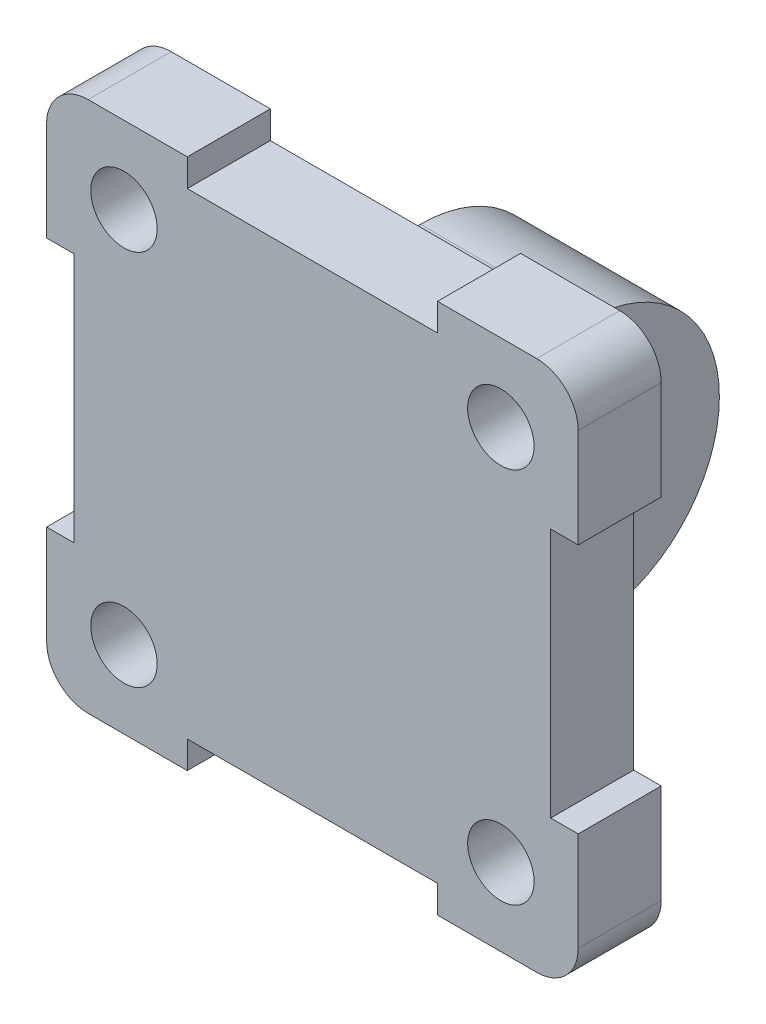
ISO-10303-21;
HEADER;
FILE_DESCRIPTION(('STEP AP214'),'2;1');
FILE_NAME('part.step','',(''),(''),'','','');
FILE_SCHEMA(('AUTOMOTIVE_DESIGN { 1 0 10303 214 1 1 1 1 }'));
ENDSEC;
DATA;
#1=APPLICATION_CONTEXT('core data for automotive mechanical design processes');
#2=APPLICATION_PROTOCOL_DEFINITION('international standard','automotive_design',2000,#1);
#3=PRODUCT_CONTEXT('',#1,'mechanical');
#4=PRODUCT('Part','Part','',(#3));
#5=PRODUCT_RELATED_PRODUCT_CATEGORY('part','',(#4));
#6=PRODUCT_DEFINITION_FORMATION('','',#4);
#7=PRODUCT_DEFINITION_CONTEXT('part definition',#1,'design');
#8=PRODUCT_DEFINITION('design','',#6,#7);
#9=PRODUCT_DEFINITION_SHAPE('','',#8);
#10=(LENGTH_UNIT() NAMED_UNIT(*) SI_UNIT(.MILLI.,.METRE.));
#11=(NAMED_UNIT(*) PLANE_ANGLE_UNIT() SI_UNIT($,.RADIAN.));
#12=(NAMED_UNIT(*) SI_UNIT($,.STERADIAN.) SOLID_ANGLE_UNIT());
#13=UNCERTAINTY_MEASURE_WITH_UNIT(LENGTH_MEASURE(1.E-05),#10,'distance_accuracy_value','');
#14=(GEOMETRIC_REPRESENTATION_CONTEXT(3) GLOBAL_UNCERTAINTY_ASSIGNED_CONTEXT((#13)) GLOBAL_UNIT_ASSIGNED_CONTEXT((#10,
#11,#12)) REPRESENTATION_CONTEXT('',''));
#15=CARTESIAN_POINT('',(0.,0.,0.));
#16=DIRECTION('',(0.,0.,1.));
#17=DIRECTION('',(1.,0.,0.));
#18=AXIS2_PLACEMENT_3D('',#15,#16,#17);
#19=CARTESIAN_POINT('',(27.,27.,0.));
#20=DIRECTION('',(0.,0.,1.));
#21=DIRECTION('',(1.,0.,0.));
#22=AXIS2_PLACEMENT_3D('',#19,#20,#21);
#23=PLANE('',#22);
#24=CARTESIAN_POINT('',(-22.69,-22.69,0.));
#25=DIRECTION('',(0.,0.,1.));
#26=DIRECTION('',(1.,0.,0.));
#27=AXIS2_PLACEMENT_3D('',#24,#25,#26);
#28=CIRCLE('',#27,4.);
#29=CARTESIAN_POINT('',(-18.69,-22.69,0.));
#30=VERTEX_POINT('',#29);
#31=EDGE_CURVE('E256',#30,#30,#28,.T.);
#32=ORIENTED_EDGE('',*,*,#31,.T.);
#33=EDGE_LOOP('',(#32));
#34=FACE_BOUND('',#33,.T.);
#35=CARTESIAN_POINT('',(22.69,22.69,0.));
#36=DIRECTION('',(0.,0.,1.));
#37=DIRECTION('',(1.,0.,0.));
#38=AXIS2_PLACEMENT_3D('',#35,#36,#37);
#39=CIRCLE('',#38,4.);
#40=CARTESIAN_POINT('',(26.69,22.69,0.));
#41=VERTEX_POINT('',#40);
#42=EDGE_CURVE('E266',#41,#41,#39,.T.);
#43=ORIENTED_EDGE('',*,*,#42,.T.);
#44=EDGE_LOOP('',(#43));
#45=FACE_BOUND('',#44,.T.);
#46=DIRECTION('',(0.,1.,0.));
#47=VECTOR('',#46,1.);
#48=CARTESIAN_POINT('',(-15.065,32.,0.));
#49=LINE('',#48,#47);
#50=CARTESIAN_POINT('',(-15.065,28.69,0.));
#51=VERTEX_POINT('',#50);
#52=CARTESIAN_POINT('',(-15.065,32.,0.));
#53=VERTEX_POINT('',#52);
#54=EDGE_CURVE('E278',#51,#53,#49,.T.);
#55=ORIENTED_EDGE('',*,*,#54,.F.);
#56=DIRECTION('',(-1.,0.,0.));
#57=VECTOR('',#56,1.);
#58=CARTESIAN_POINT('',(-15.065,28.69,0.));
#59=LINE('',#58,#57);
#60=CARTESIAN_POINT('',(15.065,28.69,0.));
#61=VERTEX_POINT('',#60);
#62=EDGE_CURVE('E285',#61,#51,#59,.T.);
#63=ORIENTED_EDGE('',*,*,#62,.F.);
#64=DIRECTION('',(0.,-1.,0.));
#65=VECTOR('',#64,1.);
#66=CARTESIAN_POINT('',(15.065,32.,0.));
#67=LINE('',#66,#65);
#68=CARTESIAN_POINT('',(15.065,32.,0.));
#69=VERTEX_POINT('',#68);
#70=EDGE_CURVE('E376',#69,#61,#67,.T.);
#71=ORIENTED_EDGE('',*,*,#70,.F.);
#72=DIRECTION('',(-1.,0.,0.));
#73=VECTOR('',#72,1.);
#74=CARTESIAN_POINT('',(15.065,32.,0.));
#75=LINE('',#74,#73);
#76=CARTESIAN_POINT('',(27.,32.,0.));
#77=VERTEX_POINT('',#76);
#78=EDGE_CURVE('E374',#77,#69,#75,.T.);
#79=ORIENTED_EDGE('',*,*,#78,.F.);
#80=CARTESIAN_POINT('',(27.,27.,0.));
#81=DIRECTION('',(0.,0.,1.));
#82=DIRECTION('',(1.,0.,0.));
#83=AXIS2_PLACEMENT_3D('',#80,#81,#82);
#84=CIRCLE('',#83,5.);
#85=CARTESIAN_POINT('',(32.,27.,0.));
#86=VERTEX_POINT('',#85);
#87=EDGE_CURVE('E372',#86,#77,#84,.T.);
#88=ORIENTED_EDGE('',*,*,#87,.F.);
#89=DIRECTION('',(0.,1.,0.));
#90=VECTOR('',#89,1.);
#91=CARTESIAN_POINT('',(32.,15.065,0.));
#92=LINE('',#91,#90);
#93=CARTESIAN_POINT('',(32.,15.065,0.));
#94=VERTEX_POINT('',#93);
#95=EDGE_CURVE('E370',#94,#86,#92,.T.);
#96=ORIENTED_EDGE('',*,*,#95,.F.);
#97=DIRECTION('',(1.,0.,0.));
#98=VECTOR('',#97,1.);
#99=CARTESIAN_POINT('',(32.,15.065,0.));
#100=LINE('',#99,#98);
#101=CARTESIAN_POINT('',(28.69,15.065,0.));
#102=VERTEX_POINT('',#101);
#103=EDGE_CURVE('E368',#102,#94,#100,.T.);
#104=ORIENTED_EDGE('',*,*,#103,.F.);
#105=DIRECTION('',(0.,1.,0.));
#106=VECTOR('',#105,1.);
#107=CARTESIAN_POINT('',(28.69,-15.065,0.));
#108=LINE('',#107,#106);
#109=CARTESIAN_POINT('',(28.69,-15.065,0.));
#110=VERTEX_POINT('',#109);
#111=EDGE_CURVE('E366',#110,#102,#108,.T.);
#112=ORIENTED_EDGE('',*,*,#111,.F.);
#113=DIRECTION('',(-1.,0.,0.));
#114=VECTOR('',#113,1.);
#115=CARTESIAN_POINT('',(32.,-15.065,0.));
#116=LINE('',#115,#114);
#117=CARTESIAN_POINT('',(32.,-15.065,0.));
#118=VERTEX_POINT('',#117);
#119=EDGE_CURVE('E364',#118,#110,#116,.T.);
#120=ORIENTED_EDGE('',*,*,#119,.F.);
#121=DIRECTION('',(0.,1.,0.));
#122=VECTOR('',#121,1.);
#123=CARTESIAN_POINT('',(32.,-27.,0.));
#124=LINE('',#123,#122);
#125=CARTESIAN_POINT('',(32.,-27.,0.));
#126=VERTEX_POINT('',#125);
#127=EDGE_CURVE('E362',#126,#118,#124,.T.);
#128=ORIENTED_EDGE('',*,*,#127,.F.);
#129=CARTESIAN_POINT('',(27.,-27.,0.));
#130=DIRECTION('',(0.,0.,1.));
#131=DIRECTION('',(1.,0.,0.));
#132=AXIS2_PLACEMENT_3D('',#129,#130,#131);
#133=CIRCLE('',#132,5.);
#134=CARTESIAN_POINT('',(27.,-32.,0.));
#135=VERTEX_POINT('',#134);
#136=EDGE_CURVE('E360',#135,#126,#133,.T.);
#137=ORIENTED_EDGE('',*,*,#136,.F.);
#138=DIRECTION('',(1.,0.,0.));
#139=VECTOR('',#138,1.);
#140=CARTESIAN_POINT('',(15.065,-32.,0.));
#141=LINE('',#140,#139);
#142=CARTESIAN_POINT('',(15.065,-32.,0.));
#143=VERTEX_POINT('',#142);
#144=EDGE_CURVE('E358',#143,#135,#141,.T.);
#145=ORIENTED_EDGE('',*,*,#144,.F.);
#146=DIRECTION('',(0.,-1.,0.));
#147=VECTOR('',#146,1.);
#148=CARTESIAN_POINT('',(15.065,-32.,0.));
#149=LINE('',#148,#147);
#150=CARTESIAN_POINT('',(15.065,-28.69,0.));
#151=VERTEX_POINT('',#150);
#152=EDGE_CURVE('E356',#151,#143,#149,.T.);
#153=ORIENTED_EDGE('',*,*,#152,.F.);
#154=DIRECTION('',(1.,0.,0.));
#155=VECTOR('',#154,1.);
#156=CARTESIAN_POINT('',(-15.065,-28.69,0.));
#157=LINE('',#156,#155);
#158=CARTESIAN_POINT('',(-15.065,-28.69,0.));
#159=VERTEX_POINT('',#158);
#160=EDGE_CURVE('E354',#159,#151,#157,.T.);
#161=ORIENTED_EDGE('',*,*,#160,.F.);
#162=DIRECTION('',(0.,1.,0.));
#163=VECTOR('',#162,1.);
#164=CARTESIAN_POINT('',(-15.065,-32.,0.));
#165=LINE('',#164,#163);
#166=CARTESIAN_POINT('',(-15.065,-32.,0.));
#167=VERTEX_POINT('',#166);
#168=EDGE_CURVE('E352',#167,#159,#165,.T.);
#169=ORIENTED_EDGE('',*,*,#168,.F.);
#170=DIRECTION('',(1.,0.,0.));
#171=VECTOR('',#170,1.);
#172=CARTESIAN_POINT('',(-27.,-32.,0.));
#173=LINE('',#172,#171);
#174=CARTESIAN_POINT('',(-27.,-32.,0.));
#175=VERTEX_POINT('',#174);
#176=EDGE_CURVE('E350',#175,#167,#173,.T.);
#177=ORIENTED_EDGE('',*,*,#176,.F.);
#178=CARTESIAN_POINT('',(-27.,-27.,0.));
#179=DIRECTION('',(0.,0.,1.));
#180=DIRECTION('',(1.,0.,0.));
#181=AXIS2_PLACEMENT_3D('',#178,#179,#180);
#182=CIRCLE('',#181,5.);
#183=CARTESIAN_POINT('',(-32.,-27.,0.));
#184=VERTEX_POINT('',#183);
#185=EDGE_CURVE('E348',#184,#175,#182,.T.);
#186=ORIENTED_EDGE('',*,*,#185,.F.);
#187=DIRECTION('',(0.,-1.,0.));
#188=VECTOR('',#187,1.);
#189=CARTESIAN_POINT('',(-32.,-27.,0.));
#190=LINE('',#189,#188);
#191=CARTESIAN_POINT('',(-32.,-15.065,0.));
#192=VERTEX_POINT('',#191);
#193=EDGE_CURVE('E346',#192,#184,#190,.T.);
#194=ORIENTED_EDGE('',*,*,#193,.F.);
#195=DIRECTION('',(-1.,0.,0.));
#196=VECTOR('',#195,1.);
#197=CARTESIAN_POINT('',(-32.,-15.065,0.));
#198=LINE('',#197,#196);
#199=CARTESIAN_POINT('',(-28.69,-15.065,0.));
#200=VERTEX_POINT('',#199);
#201=EDGE_CURVE('E344',#200,#192,#198,.T.);
#202=ORIENTED_EDGE('',*,*,#201,.F.);
#203=DIRECTION('',(0.,-1.,0.));
#204=VECTOR('',#203,1.);
#205=CARTESIAN_POINT('',(-28.69,15.065,0.));
#206=LINE('',#205,#204);
#207=CARTESIAN_POINT('',(-28.69,15.065,0.));
#208=VERTEX_POINT('',#207);
#209=EDGE_CURVE('E342',#208,#200,#206,.T.);
#210=ORIENTED_EDGE('',*,*,#209,.F.);
#211=DIRECTION('',(1.,0.,0.));
#212=VECTOR('',#211,1.);
#213=CARTESIAN_POINT('',(-32.,15.065,0.));
#214=LINE('',#213,#212);
#215=CARTESIAN_POINT('',(-32.,15.065,0.));
#216=VERTEX_POINT('',#215);
#217=EDGE_CURVE('E340',#216,#208,#214,.T.);
#218=ORIENTED_EDGE('',*,*,#217,.F.);
#219=DIRECTION('',(0.,-1.,0.));
#220=VECTOR('',#219,1.);
#221=CARTESIAN_POINT('',(-32.,15.065,0.));
#222=LINE('',#221,#220);
#223=CARTESIAN_POINT('',(-32.,27.,0.));
#224=VERTEX_POINT('',#223);
#225=EDGE_CURVE('E338',#224,#216,#222,.T.);
#226=ORIENTED_EDGE('',*,*,#225,.F.);
#227=CARTESIAN_POINT('',(-27.,27.,0.));
#228=DIRECTION('',(0.,0.,1.));
#229=DIRECTION('',(-1.,0.,0.));
#230=AXIS2_PLACEMENT_3D('',#227,#228,#229);
#231=CIRCLE('',#230,5.);
#232=CARTESIAN_POINT('',(-27.,32.,0.));
#233=VERTEX_POINT('',#232);
#234=EDGE_CURVE('E336',#233,#224,#231,.T.);
#235=ORIENTED_EDGE('',*,*,#234,.F.);
#236=DIRECTION('',(-1.,0.,0.));
#237=VECTOR('',#236,1.);
#238=CARTESIAN_POINT('',(-27.,32.,0.));
#239=LINE('',#238,#237);
#240=EDGE_CURVE('E334',#53,#233,#239,.T.);
#241=ORIENTED_EDGE('',*,*,#240,.F.);
#242=EDGE_LOOP('',(#55,#63,#71,#79,#88,#96,#104,#112,#120,#128,#137,#145,#153,#161,#169,#177,
#186,#194,#202,#210,#218,#226,#235,#241));
#243=FACE_BOUND('',#242,.T.);
#244=CARTESIAN_POINT('',(-22.69,22.69,0.));
#245=DIRECTION('',(0.,0.,1.));
#246=DIRECTION('',(1.,0.,0.));
#247=AXIS2_PLACEMENT_3D('',#244,#245,#246);
#248=CIRCLE('',#247,4.);
#249=CARTESIAN_POINT('',(-18.69,22.69,0.));
#250=VERTEX_POINT('',#249);
#251=EDGE_CURVE('E272',#250,#250,#248,.T.);
#252=ORIENTED_EDGE('',*,*,#251,.T.);
#253=EDGE_LOOP('',(#252));
#254=FACE_BOUND('',#253,.T.);
#255=CARTESIAN_POINT('',(22.69,-22.69,0.));
#256=DIRECTION('',(0.,0.,1.));
#257=DIRECTION('',(1.,0.,0.));
#258=AXIS2_PLACEMENT_3D('',#255,#256,#257);
#259=CIRCLE('',#258,4.);
#260=CARTESIAN_POINT('',(26.69,-22.69,0.));
#261=VERTEX_POINT('',#260);
#262=EDGE_CURVE('E260',#261,#261,#259,.T.);
#263=ORIENTED_EDGE('',*,*,#262,.T.);
#264=EDGE_LOOP('',(#263));
#265=FACE_BOUND('',#264,.T.);
#266=DIRECTION('',(-1.,0.,0.));
#267=VECTOR('',#266,1.);
#268=CARTESIAN_POINT('',(10.,-16.,0.));
#269=LINE('',#268,#267);
#270=CARTESIAN_POINT('',(10.,-16.,0.));
#271=VERTEX_POINT('',#270);
#272=CARTESIAN_POINT('',(-10.,-16.,0.));
#273=VERTEX_POINT('',#272);
#274=EDGE_CURVE('E49',#271,#273,#269,.T.);
#275=ORIENTED_EDGE('',*,*,#274,.F.);
#276=DIRECTION('',(0.,-1.,0.));
#277=VECTOR('',#276,1.);
#278=CARTESIAN_POINT('',(10.,16.,0.));
#279=LINE('',#278,#277);
#280=CARTESIAN_POINT('',(10.,16.,0.));
#281=VERTEX_POINT('',#280);
#282=EDGE_CURVE('E225',#281,#271,#279,.T.);
#283=ORIENTED_EDGE('',*,*,#282,.F.);
#284=DIRECTION('',(-1.,0.,0.));
#285=VECTOR('',#284,1.);
#286=CARTESIAN_POINT('',(10.,16.,0.));
#287=LINE('',#286,#285);
#288=CARTESIAN_POINT('',(-10.,16.,0.));
#289=VERTEX_POINT('',#288);
#290=EDGE_CURVE('E241',#281,#289,#287,.T.);
#291=ORIENTED_EDGE('',*,*,#290,.T.);
#292=DIRECTION('',(0.,-1.,0.));
#293=VECTOR('',#292,1.);
#294=CARTESIAN_POINT('',(-10.,16.,0.));
#295=LINE('',#294,#293);
#296=EDGE_CURVE('E54',#289,#273,#295,.T.);
#297=ORIENTED_EDGE('',*,*,#296,.T.);
#298=EDGE_LOOP('',(#275,#283,#291,#297));
#299=FACE_BOUND('',#298,.T.);
#300=ADVANCED_FACE('F34',(#34,#45,#243,#254,#265,#299),#23,.F.);
#301=CARTESIAN_POINT('',(27.,27.,10.));
#302=DIRECTION('',(0.,0.,1.));
#303=DIRECTION('',(1.,0.,0.));
#304=AXIS2_PLACEMENT_3D('',#301,#302,#303);
#305=PLANE('',#304);
#306=CARTESIAN_POINT('',(22.69,-22.69,10.));
#307=DIRECTION('',(0.,0.,1.));
#308=DIRECTION('',(1.,0.,0.));
#309=AXIS2_PLACEMENT_3D('',#306,#307,#308);
#310=CIRCLE('',#309,4.);
#311=CARTESIAN_POINT('',(26.69,-22.69,10.));
#312=VERTEX_POINT('',#311);
#313=EDGE_CURVE('E263',#312,#312,#310,.T.);
#314=ORIENTED_EDGE('',*,*,#313,.F.);
#315=EDGE_LOOP('',(#314));
#316=FACE_BOUND('',#315,.T.);
#317=CARTESIAN_POINT('',(-22.69,22.69,10.));
#318=DIRECTION('',(0.,0.,1.));
#319=DIRECTION('',(1.,0.,0.));
#320=AXIS2_PLACEMENT_3D('',#317,#318,#319);
#321=CIRCLE('',#320,4.);
#322=CARTESIAN_POINT('',(-18.69,22.69,10.));
#323=VERTEX_POINT('',#322);
#324=EDGE_CURVE('E275',#323,#323,#321,.T.);
#325=ORIENTED_EDGE('',*,*,#324,.F.);
#326=EDGE_LOOP('',(#325));
#327=FACE_BOUND('',#326,.T.);
#328=DIRECTION('',(0.,1.,0.));
#329=VECTOR('',#328,1.);
#330=CARTESIAN_POINT('',(-15.065,32.,10.));
#331=LINE('',#330,#329);
#332=CARTESIAN_POINT('',(-15.065,28.69,10.));
#333=VERTEX_POINT('',#332);
#334=CARTESIAN_POINT('',(-15.065,32.,10.));
#335=VERTEX_POINT('',#334);
#336=EDGE_CURVE('E281',#333,#335,#331,.T.);
#337=ORIENTED_EDGE('',*,*,#336,.T.);
#338=DIRECTION('',(-1.,0.,0.));
#339=VECTOR('',#338,1.);
#340=CARTESIAN_POINT('',(-27.,32.,10.));
#341=LINE('',#340,#339);
#342=CARTESIAN_POINT('',(-27.,32.,10.));
#343=VERTEX_POINT('',#342);
#344=EDGE_CURVE('E284',#335,#343,#341,.T.);
#345=ORIENTED_EDGE('',*,*,#344,.T.);
#346=CARTESIAN_POINT('',(-27.,27.,10.));
#347=DIRECTION('',(0.,0.,1.));
#348=DIRECTION('',(-1.,0.,0.));
#349=AXIS2_PLACEMENT_3D('',#346,#347,#348);
#350=CIRCLE('',#349,5.);
#351=CARTESIAN_POINT('',(-32.,27.,10.));
#352=VERTEX_POINT('',#351);
#353=EDGE_CURVE('E287',#343,#352,#350,.T.);
#354=ORIENTED_EDGE('',*,*,#353,.T.);
#355=DIRECTION('',(0.,-1.,0.));
#356=VECTOR('',#355,1.);
#357=CARTESIAN_POINT('',(-32.,15.065,10.));
#358=LINE('',#357,#356);
#359=CARTESIAN_POINT('',(-32.,15.065,10.));
#360=VERTEX_POINT('',#359);
#361=EDGE_CURVE('E289',#352,#360,#358,.T.);
#362=ORIENTED_EDGE('',*,*,#361,.T.);
#363=DIRECTION('',(1.,0.,0.));
#364=VECTOR('',#363,1.);
#365=CARTESIAN_POINT('',(-32.,15.065,10.));
#366=LINE('',#365,#364);
#367=CARTESIAN_POINT('',(-28.69,15.065,10.));
#368=VERTEX_POINT('',#367);
#369=EDGE_CURVE('E291',#360,#368,#366,.T.);
#370=ORIENTED_EDGE('',*,*,#369,.T.);
#371=DIRECTION('',(0.,-1.,0.));
#372=VECTOR('',#371,1.);
#373=CARTESIAN_POINT('',(-28.69,15.065,10.));
#374=LINE('',#373,#372);
#375=CARTESIAN_POINT('',(-28.69,-15.065,10.));
#376=VERTEX_POINT('',#375);
#377=EDGE_CURVE('E293',#368,#376,#374,.T.);
#378=ORIENTED_EDGE('',*,*,#377,.T.);
#379=DIRECTION('',(-1.,0.,0.));
#380=VECTOR('',#379,1.);
#381=CARTESIAN_POINT('',(-32.,-15.065,10.));
#382=LINE('',#381,#380);
#383=CARTESIAN_POINT('',(-32.,-15.065,10.));
#384=VERTEX_POINT('',#383);
#385=EDGE_CURVE('E295',#376,#384,#382,.T.);
#386=ORIENTED_EDGE('',*,*,#385,.T.);
#387=DIRECTION('',(0.,-1.,0.));
#388=VECTOR('',#387,1.);
#389=CARTESIAN_POINT('',(-32.,-27.,10.));
#390=LINE('',#389,#388);
#391=CARTESIAN_POINT('',(-32.,-27.,10.));
#392=VERTEX_POINT('',#391);
#393=EDGE_CURVE('E297',#384,#392,#390,.T.);
#394=ORIENTED_EDGE('',*,*,#393,.T.);
#395=CARTESIAN_POINT('',(-27.,-27.,10.));
#396=DIRECTION('',(0.,0.,1.));
#397=DIRECTION('',(1.,0.,0.));
#398=AXIS2_PLACEMENT_3D('',#395,#396,#397);
#399=CIRCLE('',#398,5.);
#400=CARTESIAN_POINT('',(-27.,-32.,10.));
#401=VERTEX_POINT('',#400);
#402=EDGE_CURVE('E299',#392,#401,#399,.T.);
#403=ORIENTED_EDGE('',*,*,#402,.T.);
#404=DIRECTION('',(1.,0.,0.));
#405=VECTOR('',#404,1.);
#406=CARTESIAN_POINT('',(-27.,-32.,10.));
#407=LINE('',#406,#405);
#408=CARTESIAN_POINT('',(-15.065,-32.,10.));
#409=VERTEX_POINT('',#408);
#410=EDGE_CURVE('E301',#401,#409,#407,.T.);
#411=ORIENTED_EDGE('',*,*,#410,.T.);
#412=DIRECTION('',(0.,1.,0.));
#413=VECTOR('',#412,1.);
#414=CARTESIAN_POINT('',(-15.065,-32.,10.));
#415=LINE('',#414,#413);
#416=CARTESIAN_POINT('',(-15.065,-28.69,10.));
#417=VERTEX_POINT('',#416);
#418=EDGE_CURVE('E303',#409,#417,#415,.T.);
#419=ORIENTED_EDGE('',*,*,#418,.T.);
#420=DIRECTION('',(1.,0.,0.));
#421=VECTOR('',#420,1.);
#422=CARTESIAN_POINT('',(-15.065,-28.69,10.));
#423=LINE('',#422,#421);
#424=CARTESIAN_POINT('',(15.065,-28.69,10.));
#425=VERTEX_POINT('',#424);
#426=EDGE_CURVE('E305',#417,#425,#423,.T.);
#427=ORIENTED_EDGE('',*,*,#426,.T.);
#428=DIRECTION('',(0.,-1.,0.));
#429=VECTOR('',#428,1.);
#430=CARTESIAN_POINT('',(15.065,-32.,10.));
#431=LINE('',#430,#429);
#432=CARTESIAN_POINT('',(15.065,-32.,10.));
#433=VERTEX_POINT('',#432);
#434=EDGE_CURVE('E307',#425,#433,#431,.T.);
#435=ORIENTED_EDGE('',*,*,#434,.T.);
#436=DIRECTION('',(1.,0.,0.));
#437=VECTOR('',#436,1.);
#438=CARTESIAN_POINT('',(15.065,-32.,10.));
#439=LINE('',#438,#437);
#440=CARTESIAN_POINT('',(27.,-32.,10.));
#441=VERTEX_POINT('',#440);
#442=EDGE_CURVE('E309',#433,#441,#439,.T.);
#443=ORIENTED_EDGE('',*,*,#442,.T.);
#444=CARTESIAN_POINT('',(27.,-27.,10.));
#445=DIRECTION('',(0.,0.,1.));
#446=DIRECTION('',(1.,0.,0.));
#447=AXIS2_PLACEMENT_3D('',#444,#445,#446);
#448=CIRCLE('',#447,5.);
#449=CARTESIAN_POINT('',(32.,-27.,10.));
#450=VERTEX_POINT('',#449);
#451=EDGE_CURVE('E311',#441,#450,#448,.T.);
#452=ORIENTED_EDGE('',*,*,#451,.T.);
#453=DIRECTION('',(0.,1.,0.));
#454=VECTOR('',#453,1.);
#455=CARTESIAN_POINT('',(32.,-27.,10.));
#456=LINE('',#455,#454);
#457=CARTESIAN_POINT('',(32.,-15.065,10.));
#458=VERTEX_POINT('',#457);
#459=EDGE_CURVE('E313',#450,#458,#456,.T.);
#460=ORIENTED_EDGE('',*,*,#459,.T.);
#461=DIRECTION('',(-1.,0.,0.));
#462=VECTOR('',#461,1.);
#463=CARTESIAN_POINT('',(32.,-15.065,10.));
#464=LINE('',#463,#462);
#465=CARTESIAN_POINT('',(28.69,-15.065,10.));
#466=VERTEX_POINT('',#465);
#467=EDGE_CURVE('E315',#458,#466,#464,.T.);
#468=ORIENTED_EDGE('',*,*,#467,.T.);
#469=DIRECTION('',(0.,1.,0.));
#470=VECTOR('',#469,1.);
#471=CARTESIAN_POINT('',(28.69,-15.065,10.));
#472=LINE('',#471,#470);
#473=CARTESIAN_POINT('',(28.69,15.065,10.));
#474=VERTEX_POINT('',#473);
#475=EDGE_CURVE('E317',#466,#474,#472,.T.);
#476=ORIENTED_EDGE('',*,*,#475,.T.);
#477=DIRECTION('',(1.,0.,0.));
#478=VECTOR('',#477,1.);
#479=CARTESIAN_POINT('',(32.,15.065,10.));
#480=LINE('',#479,#478);
#481=CARTESIAN_POINT('',(32.,15.065,10.));
#482=VERTEX_POINT('',#481);
#483=EDGE_CURVE('E319',#474,#482,#480,.T.);
#484=ORIENTED_EDGE('',*,*,#483,.T.);
#485=DIRECTION('',(0.,1.,0.));
#486=VECTOR('',#485,1.);
#487=CARTESIAN_POINT('',(32.,15.065,10.));
#488=LINE('',#487,#486);
#489=CARTESIAN_POINT('',(32.,27.,10.));
#490=VERTEX_POINT('',#489);
#491=EDGE_CURVE('E321',#482,#490,#488,.T.);
#492=ORIENTED_EDGE('',*,*,#491,.T.);
#493=CARTESIAN_POINT('',(27.,27.,10.));
#494=DIRECTION('',(0.,0.,1.));
#495=DIRECTION('',(1.,0.,0.));
#496=AXIS2_PLACEMENT_3D('',#493,#494,#495);
#497=CIRCLE('',#496,5.);
#498=CARTESIAN_POINT('',(27.,32.,10.));
#499=VERTEX_POINT('',#498);
#500=EDGE_CURVE('E323',#490,#499,#497,.T.);
#501=ORIENTED_EDGE('',*,*,#500,.T.);
#502=DIRECTION('',(-1.,0.,0.));
#503=VECTOR('',#502,1.);
#504=CARTESIAN_POINT('',(15.065,32.,10.));
#505=LINE('',#504,#503);
#506=CARTESIAN_POINT('',(15.065,32.,10.));
#507=VERTEX_POINT('',#506);
#508=EDGE_CURVE('E325',#499,#507,#505,.T.);
#509=ORIENTED_EDGE('',*,*,#508,.T.);
#510=DIRECTION('',(0.,-1.,0.));
#511=VECTOR('',#510,1.);
#512=CARTESIAN_POINT('',(15.065,32.,10.));
#513=LINE('',#512,#511);
#514=CARTESIAN_POINT('',(15.065,28.69,10.));
#515=VERTEX_POINT('',#514);
#516=EDGE_CURVE('E327',#507,#515,#513,.T.);
#517=ORIENTED_EDGE('',*,*,#516,.T.);
#518=DIRECTION('',(-1.,0.,0.));
#519=VECTOR('',#518,1.);
#520=CARTESIAN_POINT('',(-15.065,28.69,10.));
#521=LINE('',#520,#519);
#522=EDGE_CURVE('E329',#515,#333,#521,.T.);
#523=ORIENTED_EDGE('',*,*,#522,.T.);
#524=EDGE_LOOP('',(#337,#345,#354,#362,#370,#378,#386,#394,#403,#411,#419,#427,#435,#443,#452,
#460,#468,#476,#484,#492,#501,#509,#517,#523));
#525=FACE_BOUND('',#524,.T.);
#526=CARTESIAN_POINT('',(22.69,22.69,10.));
#527=DIRECTION('',(0.,0.,1.));
#528=DIRECTION('',(1.,0.,0.));
#529=AXIS2_PLACEMENT_3D('',#526,#527,#528);
#530=CIRCLE('',#529,4.);
#531=CARTESIAN_POINT('',(26.69,22.69,10.));
#532=VERTEX_POINT('',#531);
#533=EDGE_CURVE('E269',#532,#532,#530,.T.);
#534=ORIENTED_EDGE('',*,*,#533,.F.);
#535=EDGE_LOOP('',(#534));
#536=FACE_BOUND('',#535,.T.);
#537=CARTESIAN_POINT('',(-22.69,-22.69,10.));
#538=DIRECTION('',(0.,0.,1.));
#539=DIRECTION('',(1.,0.,0.));
#540=AXIS2_PLACEMENT_3D('',#537,#538,#539);
#541=CIRCLE('',#540,4.);
#542=CARTESIAN_POINT('',(-18.69,-22.69,10.));
#543=VERTEX_POINT('',#542);
#544=EDGE_CURVE('E257',#543,#543,#541,.T.);
#545=ORIENTED_EDGE('',*,*,#544,.F.);
#546=EDGE_LOOP('',(#545));
#547=FACE_BOUND('',#546,.T.);
#548=ADVANCED_FACE('F467',(#316,#327,#525,#536,#547),#305,.T.);
#549=CARTESIAN_POINT('',(-15.065,32.,10.));
#550=DIRECTION('',(-1.,0.,0.));
#551=DIRECTION('',(0.,0.,1.));
#552=AXIS2_PLACEMENT_3D('',#549,#550,#551);
#553=PLANE('',#552);
#554=ORIENTED_EDGE('',*,*,#54,.T.);
#555=DIRECTION('',(0.,0.,-1.));
#556=VECTOR('',#555,1.);
#557=CARTESIAN_POINT('',(-15.065,32.,10.));
#558=LINE('',#557,#556);
#559=EDGE_CURVE('E11',#335,#53,#558,.T.);
#560=ORIENTED_EDGE('',*,*,#559,.F.);
#561=ORIENTED_EDGE('',*,*,#336,.F.);
#562=DIRECTION('',(0.,0.,-1.));
#563=VECTOR('',#562,1.);
#564=CARTESIAN_POINT('',(-15.065,28.69,10.));
#565=LINE('',#564,#563);
#566=EDGE_CURVE('E331',#333,#51,#565,.T.);
#567=ORIENTED_EDGE('',*,*,#566,.T.);
#568=EDGE_LOOP('',(#554,#560,#561,#567));
#569=FACE_BOUND('',#568,.T.);
#570=ADVANCED_FACE('F36',(#569),#553,.F.);
#571=CARTESIAN_POINT('',(-27.,32.,10.));
#572=DIRECTION('',(0.,-1.,0.));
#573=DIRECTION('',(0.,0.,-1.));
#574=AXIS2_PLACEMENT_3D('',#571,#572,#573);
#575=PLANE('',#574);
#576=ORIENTED_EDGE('',*,*,#240,.T.);
#577=DIRECTION('',(0.,0.,-1.));
#578=VECTOR('',#577,1.);
#579=CARTESIAN_POINT('',(-27.,32.,10.));
#580=LINE('',#579,#578);
#581=EDGE_CURVE('E42',#343,#233,#580,.T.);
#582=ORIENTED_EDGE('',*,*,#581,.F.);
#583=ORIENTED_EDGE('',*,*,#344,.F.);
#584=ORIENTED_EDGE('',*,*,#559,.T.);
#585=EDGE_LOOP('',(#576,#582,#583,#584));
#586=FACE_BOUND('',#585,.T.);
#587=ADVANCED_FACE('F472',(#586),#575,.F.);
#588=CARTESIAN_POINT('',(-27.,27.,10.));
#589=DIRECTION('',(0.,0.,-1.));
#590=DIRECTION('',(-1.,0.,0.));
#591=AXIS2_PLACEMENT_3D('',#588,#589,#590);
#592=CYLINDRICAL_SURFACE('',#591,5.);
#593=ORIENTED_EDGE('',*,*,#234,.T.);
#594=DIRECTION('',(0.,0.,-1.));
#595=VECTOR('',#594,1.);
#596=CARTESIAN_POINT('',(-32.,27.,10.));
#597=LINE('',#596,#595);
#598=EDGE_CURVE('E441',#352,#224,#597,.T.);
#599=ORIENTED_EDGE('',*,*,#598,.F.);
#600=ORIENTED_EDGE('',*,*,#353,.F.);
#601=ORIENTED_EDGE('',*,*,#581,.T.);
#602=EDGE_LOOP('',(#593,#599,#600,#601));
#603=FACE_BOUND('',#602,.T.);
#604=ADVANCED_FACE('F448',(#603),#592,.T.);
#605=CARTESIAN_POINT('',(-32.,15.065,10.));
#606=DIRECTION('',(1.,0.,0.));
#607=DIRECTION('',(0.,0.,-1.));
#608=AXIS2_PLACEMENT_3D('',#605,#606,#607);
#609=PLANE('',#608);
#610=ORIENTED_EDGE('',*,*,#225,.T.);
#611=DIRECTION('',(0.,0.,-1.));
#612=VECTOR('',#611,1.);
#613=CARTESIAN_POINT('',(-32.,15.065,10.));
#614=LINE('',#613,#612);
#615=EDGE_CURVE('E438',#360,#216,#614,.T.);
#616=ORIENTED_EDGE('',*,*,#615,.F.);
#617=ORIENTED_EDGE('',*,*,#361,.F.);
#618=ORIENTED_EDGE('',*,*,#598,.T.);
#619=EDGE_LOOP('',(#610,#616,#617,#618));
#620=FACE_BOUND('',#619,.T.);
#621=ADVANCED_FACE('F459',(#620),#609,.F.);
#622=CARTESIAN_POINT('',(-32.,15.065,10.));
#623=DIRECTION('',(0.,1.,0.));
#624=DIRECTION('',(0.,0.,1.));
#625=AXIS2_PLACEMENT_3D('',#622,#623,#624);
#626=PLANE('',#625);
#627=ORIENTED_EDGE('',*,*,#217,.T.);
#628=DIRECTION('',(0.,0.,-1.));
#629=VECTOR('',#628,1.);
#630=CARTESIAN_POINT('',(-28.69,15.065,10.));
#631=LINE('',#630,#629);
#632=EDGE_CURVE('E435',#368,#208,#631,.T.);
#633=ORIENTED_EDGE('',*,*,#632,.F.);
#634=ORIENTED_EDGE('',*,*,#369,.F.);
#635=ORIENTED_EDGE('',*,*,#615,.T.);
#636=EDGE_LOOP('',(#627,#633,#634,#635));
#637=FACE_BOUND('',#636,.T.);
#638=ADVANCED_FACE('F463',(#637),#626,.F.);
#639=CARTESIAN_POINT('',(-28.69,15.065,10.));
#640=DIRECTION('',(1.,0.,0.));
#641=DIRECTION('',(0.,0.,-1.));
#642=AXIS2_PLACEMENT_3D('',#639,#640,#641);
#643=PLANE('',#642);
#644=ORIENTED_EDGE('',*,*,#209,.T.);
#645=DIRECTION('',(0.,0.,-1.));
#646=VECTOR('',#645,1.);
#647=CARTESIAN_POINT('',(-28.69,-15.065,10.));
#648=LINE('',#647,#646);
#649=EDGE_CURVE('E432',#376,#200,#648,.T.);
#650=ORIENTED_EDGE('',*,*,#649,.F.);
#651=ORIENTED_EDGE('',*,*,#377,.F.);
#652=ORIENTED_EDGE('',*,*,#632,.T.);
#653=EDGE_LOOP('',(#644,#650,#651,#652));
#654=FACE_BOUND('',#653,.T.);
#655=ADVANCED_FACE('F565',(#654),#643,.F.);
#656=CARTESIAN_POINT('',(-32.,-15.065,10.));
#657=DIRECTION('',(0.,-1.,0.));
#658=DIRECTION('',(0.,0.,-1.));
#659=AXIS2_PLACEMENT_3D('',#656,#657,#658);
#660=PLANE('',#659);
#661=ORIENTED_EDGE('',*,*,#201,.T.);
#662=DIRECTION('',(0.,0.,-1.));
#663=VECTOR('',#662,1.);
#664=CARTESIAN_POINT('',(-32.,-15.065,10.));
#665=LINE('',#664,#663);
#666=EDGE_CURVE('E429',#384,#192,#665,.T.);
#667=ORIENTED_EDGE('',*,*,#666,.F.);
#668=ORIENTED_EDGE('',*,*,#385,.F.);
#669=ORIENTED_EDGE('',*,*,#649,.T.);
#670=EDGE_LOOP('',(#661,#667,#668,#669));
#671=FACE_BOUND('',#670,.T.);
#672=ADVANCED_FACE('F563',(#671),#660,.F.);
#673=CARTESIAN_POINT('',(-32.,-27.,10.));
#674=DIRECTION('',(1.,0.,0.));
#675=DIRECTION('',(0.,0.,-1.));
#676=AXIS2_PLACEMENT_3D('',#673,#674,#675);
#677=PLANE('',#676);
#678=ORIENTED_EDGE('',*,*,#193,.T.);
#679=DIRECTION('',(0.,0.,-1.));
#680=VECTOR('',#679,1.);
#681=CARTESIAN_POINT('',(-32.,-27.,10.));
#682=LINE('',#681,#680);
#683=EDGE_CURVE('E426',#392,#184,#682,.T.);
#684=ORIENTED_EDGE('',*,*,#683,.F.);
#685=ORIENTED_EDGE('',*,*,#393,.F.);
#686=ORIENTED_EDGE('',*,*,#666,.T.);
#687=EDGE_LOOP('',(#678,#684,#685,#686));
#688=FACE_BOUND('',#687,.T.);
#689=ADVANCED_FACE('F559',(#688),#677,.F.);
#690=CARTESIAN_POINT('',(-27.,-27.,10.));
#691=DIRECTION('',(0.,0.,-1.));
#692=DIRECTION('',(-1.,0.,0.));
#693=AXIS2_PLACEMENT_3D('',#690,#691,#692);
#694=CYLINDRICAL_SURFACE('',#693,5.);
#695=ORIENTED_EDGE('',*,*,#185,.T.);
#696=DIRECTION('',(0.,0.,-1.));
#697=VECTOR('',#696,1.);
#698=CARTESIAN_POINT('',(-27.,-32.,10.));
#699=LINE('',#698,#697);
#700=EDGE_CURVE('E423',#401,#175,#699,.T.);
#701=ORIENTED_EDGE('',*,*,#700,.F.);
#702=ORIENTED_EDGE('',*,*,#402,.F.);
#703=ORIENTED_EDGE('',*,*,#683,.T.);
#704=EDGE_LOOP('',(#695,#701,#702,#703));
#705=FACE_BOUND('',#704,.T.);
#706=ADVANCED_FACE('F554',(#705),#694,.T.);
#707=CARTESIAN_POINT('',(-27.,-32.,10.));
#708=DIRECTION('',(0.,1.,0.));
#709=DIRECTION('',(0.,0.,1.));
#710=AXIS2_PLACEMENT_3D('',#707,#708,#709);
#711=PLANE('',#710);
#712=ORIENTED_EDGE('',*,*,#176,.T.);
#713=DIRECTION('',(0.,0.,-1.));
#714=VECTOR('',#713,1.);
#715=CARTESIAN_POINT('',(-15.065,-32.,10.));
#716=LINE('',#715,#714);
#717=EDGE_CURVE('E420',#409,#167,#716,.T.);
#718=ORIENTED_EDGE('',*,*,#717,.F.);
#719=ORIENTED_EDGE('',*,*,#410,.F.);
#720=ORIENTED_EDGE('',*,*,#700,.T.);
#721=EDGE_LOOP('',(#712,#718,#719,#720));
#722=FACE_BOUND('',#721,.T.);
#723=ADVANCED_FACE('F548',(#722),#711,.F.);
#724=CARTESIAN_POINT('',(-15.065,-32.,10.));
#725=DIRECTION('',(-1.,0.,0.));
#726=DIRECTION('',(0.,-1.,0.));
#727=AXIS2_PLACEMENT_3D('',#724,#725,#726);
#728=PLANE('',#727);
#729=ORIENTED_EDGE('',*,*,#168,.T.);
#730=DIRECTION('',(0.,0.,-1.));
#731=VECTOR('',#730,1.);
#732=CARTESIAN_POINT('',(-15.065,-28.69,10.));
#733=LINE('',#732,#731);
#734=EDGE_CURVE('E417',#417,#159,#733,.T.);
#735=ORIENTED_EDGE('',*,*,#734,.F.);
#736=ORIENTED_EDGE('',*,*,#418,.F.);
#737=ORIENTED_EDGE('',*,*,#717,.T.);
#738=EDGE_LOOP('',(#729,#735,#736,#737));
#739=FACE_BOUND('',#738,.T.);
#740=ADVANCED_FACE('F544',(#739),#728,.F.);
#741=CARTESIAN_POINT('',(-15.065,-28.69,10.));
#742=DIRECTION('',(0.,1.,0.));
#743=DIRECTION('',(0.,0.,1.));
#744=AXIS2_PLACEMENT_3D('',#741,#742,#743);
#745=PLANE('',#744);
#746=ORIENTED_EDGE('',*,*,#160,.T.);
#747=DIRECTION('',(0.,0.,-1.));
#748=VECTOR('',#747,1.);
#749=CARTESIAN_POINT('',(15.065,-28.69,10.));
#750=LINE('',#749,#748);
#751=EDGE_CURVE('E414',#425,#151,#750,.T.);
#752=ORIENTED_EDGE('',*,*,#751,.F.);
#753=ORIENTED_EDGE('',*,*,#426,.F.);
#754=ORIENTED_EDGE('',*,*,#734,.T.);
#755=EDGE_LOOP('',(#746,#752,#753,#754));
#756=FACE_BOUND('',#755,.T.);
#757=ADVANCED_FACE('F539',(#756),#745,.F.);
#758=CARTESIAN_POINT('',(15.065,-32.,10.));
#759=DIRECTION('',(1.,0.,0.));
#760=DIRECTION('',(0.,1.,0.));
#761=AXIS2_PLACEMENT_3D('',#758,#759,#760);
#762=PLANE('',#761);
#763=ORIENTED_EDGE('',*,*,#152,.T.);
#764=DIRECTION('',(0.,0.,-1.));
#765=VECTOR('',#764,1.);
#766=CARTESIAN_POINT('',(15.065,-32.,10.));
#767=LINE('',#766,#765);
#768=EDGE_CURVE('E411',#433,#143,#767,.T.);
#769=ORIENTED_EDGE('',*,*,#768,.F.);
#770=ORIENTED_EDGE('',*,*,#434,.F.);
#771=ORIENTED_EDGE('',*,*,#751,.T.);
#772=EDGE_LOOP('',(#763,#769,#770,#771));
#773=FACE_BOUND('',#772,.T.);
#774=ADVANCED_FACE('F533',(#773),#762,.F.);
#775=CARTESIAN_POINT('',(15.065,-32.,10.));
#776=DIRECTION('',(0.,1.,0.));
#777=DIRECTION('',(0.,0.,1.));
#778=AXIS2_PLACEMENT_3D('',#775,#776,#777);
#779=PLANE('',#778);
#780=ORIENTED_EDGE('',*,*,#144,.T.);
#781=DIRECTION('',(0.,0.,-1.));
#782=VECTOR('',#781,1.);
#783=CARTESIAN_POINT('',(27.,-32.,10.));
#784=LINE('',#783,#782);
#785=EDGE_CURVE('E408',#441,#135,#784,.T.);
#786=ORIENTED_EDGE('',*,*,#785,.F.);
#787=ORIENTED_EDGE('',*,*,#442,.F.);
#788=ORIENTED_EDGE('',*,*,#768,.T.);
#789=EDGE_LOOP('',(#780,#786,#787,#788));
#790=FACE_BOUND('',#789,.T.);
#791=ADVANCED_FACE('F529',(#790),#779,.F.);
#792=CARTESIAN_POINT('',(27.,-27.,10.));
#793=DIRECTION('',(0.,0.,-1.));
#794=DIRECTION('',(-1.,0.,0.));
#795=AXIS2_PLACEMENT_3D('',#792,#793,#794);
#796=CYLINDRICAL_SURFACE('',#795,5.);
#797=ORIENTED_EDGE('',*,*,#136,.T.);
#798=DIRECTION('',(0.,0.,-1.));
#799=VECTOR('',#798,1.);
#800=CARTESIAN_POINT('',(32.,-27.,10.));
#801=LINE('',#800,#799);
#802=EDGE_CURVE('E405',#450,#126,#801,.T.);
#803=ORIENTED_EDGE('',*,*,#802,.F.);
#804=ORIENTED_EDGE('',*,*,#451,.F.);
#805=ORIENTED_EDGE('',*,*,#785,.T.);
#806=EDGE_LOOP('',(#797,#803,#804,#805));
#807=FACE_BOUND('',#806,.T.);
#808=ADVANCED_FACE('F524',(#807),#796,.T.);
#809=CARTESIAN_POINT('',(32.,-27.,10.));
#810=DIRECTION('',(-1.,0.,0.));
#811=DIRECTION('',(0.,0.,1.));
#812=AXIS2_PLACEMENT_3D('',#809,#810,#811);
#813=PLANE('',#812);
#814=ORIENTED_EDGE('',*,*,#127,.T.);
#815=DIRECTION('',(0.,0.,-1.));
#816=VECTOR('',#815,1.);
#817=CARTESIAN_POINT('',(32.,-15.065,10.));
#818=LINE('',#817,#816);
#819=EDGE_CURVE('E402',#458,#118,#818,.T.);
#820=ORIENTED_EDGE('',*,*,#819,.F.);
#821=ORIENTED_EDGE('',*,*,#459,.F.);
#822=ORIENTED_EDGE('',*,*,#802,.T.);
#823=EDGE_LOOP('',(#814,#820,#821,#822));
#824=FACE_BOUND('',#823,.T.);
#825=ADVANCED_FACE('F518',(#824),#813,.F.);
#826=CARTESIAN_POINT('',(32.,-15.065,10.));
#827=DIRECTION('',(0.,-1.,0.));
#828=DIRECTION('',(0.,0.,-1.));
#829=AXIS2_PLACEMENT_3D('',#826,#827,#828);
#830=PLANE('',#829);
#831=ORIENTED_EDGE('',*,*,#119,.T.);
#832=DIRECTION('',(0.,0.,-1.));
#833=VECTOR('',#832,1.);
#834=CARTESIAN_POINT('',(28.69,-15.065,10.));
#835=LINE('',#834,#833);
#836=EDGE_CURVE('E399',#466,#110,#835,.T.);
#837=ORIENTED_EDGE('',*,*,#836,.F.);
#838=ORIENTED_EDGE('',*,*,#467,.F.);
#839=ORIENTED_EDGE('',*,*,#819,.T.);
#840=EDGE_LOOP('',(#831,#837,#838,#839));
#841=FACE_BOUND('',#840,.T.);
#842=ADVANCED_FACE('F514',(#841),#830,.F.);
#843=CARTESIAN_POINT('',(28.69,-15.065,10.));
#844=DIRECTION('',(-1.,0.,0.));
#845=DIRECTION('',(0.,0.,1.));
#846=AXIS2_PLACEMENT_3D('',#843,#844,#845);
#847=PLANE('',#846);
#848=ORIENTED_EDGE('',*,*,#111,.T.);
#849=DIRECTION('',(0.,0.,-1.));
#850=VECTOR('',#849,1.);
#851=CARTESIAN_POINT('',(28.69,15.065,10.));
#852=LINE('',#851,#850);
#853=EDGE_CURVE('E396',#474,#102,#852,.T.);
#854=ORIENTED_EDGE('',*,*,#853,.F.);
#855=ORIENTED_EDGE('',*,*,#475,.F.);
#856=ORIENTED_EDGE('',*,*,#836,.T.);
#857=EDGE_LOOP('',(#848,#854,#855,#856));
#858=FACE_BOUND('',#857,.T.);
#859=ADVANCED_FACE('F509',(#858),#847,.F.);
#860=CARTESIAN_POINT('',(32.,15.065,10.));
#861=DIRECTION('',(0.,1.,0.));
#862=DIRECTION('',(0.,0.,1.));
#863=AXIS2_PLACEMENT_3D('',#860,#861,#862);
#864=PLANE('',#863);
#865=ORIENTED_EDGE('',*,*,#103,.T.);
#866=DIRECTION('',(0.,0.,-1.));
#867=VECTOR('',#866,1.);
#868=CARTESIAN_POINT('',(32.,15.065,10.));
#869=LINE('',#868,#867);
#870=EDGE_CURVE('E393',#482,#94,#869,.T.);
#871=ORIENTED_EDGE('',*,*,#870,.F.);
#872=ORIENTED_EDGE('',*,*,#483,.F.);
#873=ORIENTED_EDGE('',*,*,#853,.T.);
#874=EDGE_LOOP('',(#865,#871,#872,#873));
#875=FACE_BOUND('',#874,.T.);
#876=ADVANCED_FACE('F503',(#875),#864,.F.);
#877=CARTESIAN_POINT('',(32.,15.065,10.));
#878=DIRECTION('',(-1.,0.,0.));
#879=DIRECTION('',(0.,0.,1.));
#880=AXIS2_PLACEMENT_3D('',#877,#878,#879);
#881=PLANE('',#880);
#882=ORIENTED_EDGE('',*,*,#95,.T.);
#883=DIRECTION('',(0.,0.,-1.));
#884=VECTOR('',#883,1.);
#885=CARTESIAN_POINT('',(32.,27.,10.));
#886=LINE('',#885,#884);
#887=EDGE_CURVE('E390',#490,#86,#886,.T.);
#888=ORIENTED_EDGE('',*,*,#887,.F.);
#889=ORIENTED_EDGE('',*,*,#491,.F.);
#890=ORIENTED_EDGE('',*,*,#870,.T.);
#891=EDGE_LOOP('',(#882,#888,#889,#890));
#892=FACE_BOUND('',#891,.T.);
#893=ADVANCED_FACE('F499',(#892),#881,.F.);
#894=CARTESIAN_POINT('',(27.,27.,10.));
#895=DIRECTION('',(0.,0.,-1.));
#896=DIRECTION('',(-1.,0.,0.));
#897=AXIS2_PLACEMENT_3D('',#894,#895,#896);
#898=CYLINDRICAL_SURFACE('',#897,5.);
#899=ORIENTED_EDGE('',*,*,#87,.T.);
#900=DIRECTION('',(0.,0.,-1.));
#901=VECTOR('',#900,1.);
#902=CARTESIAN_POINT('',(27.,32.,10.));
#903=LINE('',#902,#901);
#904=EDGE_CURVE('E387',#499,#77,#903,.T.);
#905=ORIENTED_EDGE('',*,*,#904,.F.);
#906=ORIENTED_EDGE('',*,*,#500,.F.);
#907=ORIENTED_EDGE('',*,*,#887,.T.);
#908=EDGE_LOOP('',(#899,#905,#906,#907));
#909=FACE_BOUND('',#908,.T.);
#910=ADVANCED_FACE('F494',(#909),#898,.T.);
#911=CARTESIAN_POINT('',(15.065,32.,10.));
#912=DIRECTION('',(0.,-1.,0.));
#913=DIRECTION('',(0.,0.,-1.));
#914=AXIS2_PLACEMENT_3D('',#911,#912,#913);
#915=PLANE('',#914);
#916=ORIENTED_EDGE('',*,*,#78,.T.);
#917=DIRECTION('',(0.,0.,-1.));
#918=VECTOR('',#917,1.);
#919=CARTESIAN_POINT('',(15.065,32.,10.));
#920=LINE('',#919,#918);
#921=EDGE_CURVE('E384',#507,#69,#920,.T.);
#922=ORIENTED_EDGE('',*,*,#921,.F.);
#923=ORIENTED_EDGE('',*,*,#508,.F.);
#924=ORIENTED_EDGE('',*,*,#904,.T.);
#925=EDGE_LOOP('',(#916,#922,#923,#924));
#926=FACE_BOUND('',#925,.T.);
#927=ADVANCED_FACE('F488',(#926),#915,.F.);
#928=CARTESIAN_POINT('',(15.065,32.,10.));
#929=DIRECTION('',(1.,0.,0.));
#930=DIRECTION('',(0.,0.,-1.));
#931=AXIS2_PLACEMENT_3D('',#928,#929,#930);
#932=PLANE('',#931);
#933=ORIENTED_EDGE('',*,*,#70,.T.);
#934=DIRECTION('',(0.,0.,-1.));
#935=VECTOR('',#934,1.);
#936=CARTESIAN_POINT('',(15.065,28.69,10.));
#937=LINE('',#936,#935);
#938=EDGE_CURVE('E381',#515,#61,#937,.T.);
#939=ORIENTED_EDGE('',*,*,#938,.F.);
#940=ORIENTED_EDGE('',*,*,#516,.F.);
#941=ORIENTED_EDGE('',*,*,#921,.T.);
#942=EDGE_LOOP('',(#933,#939,#940,#941));
#943=FACE_BOUND('',#942,.T.);
#944=ADVANCED_FACE('F484',(#943),#932,.F.);
#945=CARTESIAN_POINT('',(-15.065,28.69,10.));
#946=DIRECTION('',(0.,-1.,0.));
#947=DIRECTION('',(0.,0.,-1.));
#948=AXIS2_PLACEMENT_3D('',#945,#946,#947);
#949=PLANE('',#948);
#950=ORIENTED_EDGE('',*,*,#62,.T.);
#951=ORIENTED_EDGE('',*,*,#566,.F.);
#952=ORIENTED_EDGE('',*,*,#522,.F.);
#953=ORIENTED_EDGE('',*,*,#938,.T.);
#954=EDGE_LOOP('',(#950,#951,#952,#953));
#955=FACE_BOUND('',#954,.T.);
#956=ADVANCED_FACE('F479',(#955),#949,.F.);
#957=CARTESIAN_POINT('',(-22.69,22.69,10.));
#958=DIRECTION('',(0.,0.,-1.));
#959=DIRECTION('',(-1.,0.,0.));
#960=AXIS2_PLACEMENT_3D('',#957,#958,#959);
#961=CYLINDRICAL_SURFACE('',#960,4.);
#962=ORIENTED_EDGE('',*,*,#324,.T.);
#963=EDGE_LOOP('',(#962));
#964=FACE_BOUND('',#963,.T.);
#965=ORIENTED_EDGE('',*,*,#251,.F.);
#966=EDGE_LOOP('',(#965));
#967=FACE_BOUND('',#966,.T.);
#968=ADVANCED_FACE('F587',(#964,#967),#961,.F.);
#969=CARTESIAN_POINT('',(22.69,22.69,10.));
#970=DIRECTION('',(0.,0.,-1.));
#971=DIRECTION('',(-1.,0.,0.));
#972=AXIS2_PLACEMENT_3D('',#969,#970,#971);
#973=CYLINDRICAL_SURFACE('',#972,4.);
#974=ORIENTED_EDGE('',*,*,#533,.T.);
#975=EDGE_LOOP('',(#974));
#976=FACE_BOUND('',#975,.T.);
#977=ORIENTED_EDGE('',*,*,#42,.F.);
#978=EDGE_LOOP('',(#977));
#979=FACE_BOUND('',#978,.T.);
#980=ADVANCED_FACE('F693',(#976,#979),#973,.F.);
#981=CARTESIAN_POINT('',(22.69,-22.69,10.));
#982=DIRECTION('',(0.,0.,-1.));
#983=DIRECTION('',(-1.,0.,0.));
#984=AXIS2_PLACEMENT_3D('',#981,#982,#983);
#985=CYLINDRICAL_SURFACE('',#984,4.);
#986=ORIENTED_EDGE('',*,*,#313,.T.);
#987=EDGE_LOOP('',(#986));
#988=FACE_BOUND('',#987,.T.);
#989=ORIENTED_EDGE('',*,*,#262,.F.);
#990=EDGE_LOOP('',(#989));
#991=FACE_BOUND('',#990,.T.);
#992=ADVANCED_FACE('F700',(#988,#991),#985,.F.);
#993=CARTESIAN_POINT('',(-22.69,-22.69,10.));
#994=DIRECTION('',(0.,0.,-1.));
#995=DIRECTION('',(-1.,0.,0.));
#996=AXIS2_PLACEMENT_3D('',#993,#994,#995);
#997=CYLINDRICAL_SURFACE('',#996,4.);
#998=ORIENTED_EDGE('',*,*,#544,.T.);
#999=EDGE_LOOP('',(#998));
#1000=FACE_BOUND('',#999,.T.);
#1001=ORIENTED_EDGE('',*,*,#31,.F.);
#1002=EDGE_LOOP('',(#1001));
#1003=FACE_BOUND('',#1002,.T.);
#1004=ADVANCED_FACE('F708',(#1000,#1003),#997,.F.);
#1005=CARTESIAN_POINT('',(10.,0.,-13.));
#1006=DIRECTION('',(-1.,0.,0.));
#1007=DIRECTION('',(0.,0.,1.));
#1008=AXIS2_PLACEMENT_3D('',#1005,#1006,#1007);
#1009=PLANE('',#1008);
#1010=ORIENTED_EDGE('',*,*,#282,.T.);
#1011=DIRECTION('',(0.,0.,-1.));
#1012=VECTOR('',#1011,1.);
#1013=CARTESIAN_POINT('',(10.,-16.,0.));
#1014=LINE('',#1013,#1012);
#1015=CARTESIAN_POINT('',(10.,-16.,-13.));
#1016=VERTEX_POINT('',#1015);
#1017=EDGE_CURVE('E217',#271,#1016,#1014,.T.);
#1018=ORIENTED_EDGE('',*,*,#1017,.T.);
#1019=CARTESIAN_POINT('',(10.,0.,-13.));
#1020=DIRECTION('',(1.,0.,0.));
#1021=DIRECTION('',(0.,0.,1.));
#1022=AXIS2_PLACEMENT_3D('',#1019,#1020,#1021);
#1023=CIRCLE('',#1022,16.);
#1024=CARTESIAN_POINT('',(10.,16.,-13.));
#1025=VERTEX_POINT('',#1024);
#1026=EDGE_CURVE('E223',#1016,#1025,#1023,.T.);
#1027=ORIENTED_EDGE('',*,*,#1026,.T.);
#1028=DIRECTION('',(0.,0.,1.));
#1029=VECTOR('',#1028,1.);
#1030=CARTESIAN_POINT('',(10.,16.,0.));
#1031=LINE('',#1030,#1029);
#1032=EDGE_CURVE('E239',#1025,#281,#1031,.T.);
#1033=ORIENTED_EDGE('',*,*,#1032,.T.);
#1034=EDGE_LOOP('',(#1010,#1018,#1027,#1033));
#1035=FACE_BOUND('',#1034,.T.);
#1036=CARTESIAN_POINT('',(10.,0.,-13.));
#1037=DIRECTION('',(1.,0.,0.));
#1038=DIRECTION('',(0.,0.,-1.));
#1039=AXIS2_PLACEMENT_3D('',#1036,#1037,#1038);
#1040=CIRCLE('',#1039,8.);
#1041=CARTESIAN_POINT('',(10.,0.,-21.));
#1042=VERTEX_POINT('',#1041);
#1043=EDGE_CURVE('E246',#1042,#1042,#1040,.T.);
#1044=ORIENTED_EDGE('',*,*,#1043,.F.);
#1045=EDGE_LOOP('',(#1044));
#1046=FACE_BOUND('',#1045,.T.);
#1047=ADVANCED_FACE('F219',(#1035,#1046),#1009,.F.);
#1048=CARTESIAN_POINT('',(-10.,0.,-13.));
#1049=DIRECTION('',(-1.,0.,0.));
#1050=DIRECTION('',(0.,0.,1.));
#1051=AXIS2_PLACEMENT_3D('',#1048,#1049,#1050);
#1052=PLANE('',#1051);
#1053=ORIENTED_EDGE('',*,*,#296,.F.);
#1054=DIRECTION('',(0.,0.,1.));
#1055=VECTOR('',#1054,1.);
#1056=CARTESIAN_POINT('',(-10.,16.,0.));
#1057=LINE('',#1056,#1055);
#1058=CARTESIAN_POINT('',(-10.,16.,-13.));
#1059=VERTEX_POINT('',#1058);
#1060=EDGE_CURVE('E250',#1059,#289,#1057,.T.);
#1061=ORIENTED_EDGE('',*,*,#1060,.F.);
#1062=CARTESIAN_POINT('',(-10.,0.,-13.));
#1063=DIRECTION('',(1.,0.,0.));
#1064=DIRECTION('',(0.,0.,1.));
#1065=AXIS2_PLACEMENT_3D('',#1062,#1063,#1064);
#1066=CIRCLE('',#1065,16.);
#1067=CARTESIAN_POINT('',(-10.,-16.,-13.));
#1068=VERTEX_POINT('',#1067);
#1069=EDGE_CURVE('E248',#1068,#1059,#1066,.T.);
#1070=ORIENTED_EDGE('',*,*,#1069,.F.);
#1071=DIRECTION('',(0.,0.,-1.));
#1072=VECTOR('',#1071,1.);
#1073=CARTESIAN_POINT('',(-10.,-16.,0.));
#1074=LINE('',#1073,#1072);
#1075=EDGE_CURVE('E231',#273,#1068,#1074,.T.);
#1076=ORIENTED_EDGE('',*,*,#1075,.F.);
#1077=EDGE_LOOP('',(#1053,#1061,#1070,#1076));
#1078=FACE_BOUND('',#1077,.T.);
#1079=CARTESIAN_POINT('',(-10.,0.,-13.));
#1080=DIRECTION('',(1.,0.,0.));
#1081=DIRECTION('',(0.,0.,-1.));
#1082=AXIS2_PLACEMENT_3D('',#1079,#1080,#1081);
#1083=CIRCLE('',#1082,8.);
#1084=CARTESIAN_POINT('',(-10.,0.,-21.));
#1085=VERTEX_POINT('',#1084);
#1086=EDGE_CURVE('E874',#1085,#1085,#1083,.T.);
#1087=ORIENTED_EDGE('',*,*,#1086,.T.);
#1088=EDGE_LOOP('',(#1087));
#1089=FACE_BOUND('',#1088,.T.);
#1090=ADVANCED_FACE('F723',(#1078,#1089),#1052,.T.);
#1091=CARTESIAN_POINT('',(10.,-16.,0.));
#1092=DIRECTION('',(0.,1.,0.));
#1093=DIRECTION('',(0.,0.,1.));
#1094=AXIS2_PLACEMENT_3D('',#1091,#1092,#1093);
#1095=PLANE('',#1094);
#1096=ORIENTED_EDGE('',*,*,#1075,.T.);
#1097=DIRECTION('',(-1.,0.,0.));
#1098=VECTOR('',#1097,1.);
#1099=CARTESIAN_POINT('',(10.,-16.,-13.));
#1100=LINE('',#1099,#1098);
#1101=EDGE_CURVE('E229',#1016,#1068,#1100,.T.);
#1102=ORIENTED_EDGE('',*,*,#1101,.F.);
#1103=ORIENTED_EDGE('',*,*,#1017,.F.);
#1104=ORIENTED_EDGE('',*,*,#274,.T.);
#1105=EDGE_LOOP('',(#1096,#1102,#1103,#1104));
#1106=FACE_BOUND('',#1105,.T.);
#1107=ADVANCED_FACE('F230',(#1106),#1095,.F.);
#1108=CARTESIAN_POINT('',(10.,0.,-13.));
#1109=DIRECTION('',(-1.,0.,0.));
#1110=DIRECTION('',(0.,0.,1.));
#1111=AXIS2_PLACEMENT_3D('',#1108,#1109,#1110);
#1112=CYLINDRICAL_SURFACE('',#1111,16.);
#1113=ORIENTED_EDGE('',*,*,#1069,.T.);
#1114=DIRECTION('',(-1.,0.,0.));
#1115=VECTOR('',#1114,1.);
#1116=CARTESIAN_POINT('',(10.,16.,-13.));
#1117=LINE('',#1116,#1115);
#1118=EDGE_CURVE('E234',#1025,#1059,#1117,.T.);
#1119=ORIENTED_EDGE('',*,*,#1118,.F.);
#1120=ORIENTED_EDGE('',*,*,#1026,.F.);
#1121=ORIENTED_EDGE('',*,*,#1101,.T.);
#1122=EDGE_LOOP('',(#1113,#1119,#1120,#1121));
#1123=FACE_BOUND('',#1122,.T.);
#1124=ADVANCED_FACE('F236',(#1123),#1112,.T.);
#1125=CARTESIAN_POINT('',(10.,16.,0.));
#1126=DIRECTION('',(0.,-1.,0.));
#1127=DIRECTION('',(0.,0.,-1.));
#1128=AXIS2_PLACEMENT_3D('',#1125,#1126,#1127);
#1129=PLANE('',#1128);
#1130=ORIENTED_EDGE('',*,*,#1060,.T.);
#1131=ORIENTED_EDGE('',*,*,#290,.F.);
#1132=ORIENTED_EDGE('',*,*,#1032,.F.);
#1133=ORIENTED_EDGE('',*,*,#1118,.T.);
#1134=EDGE_LOOP('',(#1130,#1131,#1132,#1133));
#1135=FACE_BOUND('',#1134,.T.);
#1136=ADVANCED_FACE('F743',(#1135),#1129,.F.);
#1137=CARTESIAN_POINT('',(10.,0.,-13.));
#1138=DIRECTION('',(-1.,0.,0.));
#1139=DIRECTION('',(0.,0.,1.));
#1140=AXIS2_PLACEMENT_3D('',#1137,#1138,#1139);
#1141=CYLINDRICAL_SURFACE('',#1140,8.);
#1142=ORIENTED_EDGE('',*,*,#1043,.T.);
#1143=EDGE_LOOP('',(#1142));
#1144=FACE_BOUND('',#1143,.T.);
#1145=ORIENTED_EDGE('',*,*,#1086,.F.);
#1146=EDGE_LOOP('',(#1145));
#1147=FACE_BOUND('',#1146,.T.);
#1148=ADVANCED_FACE('F750',(#1144,#1147),#1141,.F.);
#1149=CLOSED_SHELL('',(#300,#548,#570,#587,#604,#621,#638,#655,#672,#689,#706,#723,#740,#757,
#774,#791,#808,#825,#842,#859,#876,#893,#910,#927,#944,#956,#968,#980,#992,#1004,#1047,#1090,
#1107,#1124,#1136,#1148));
#1150=MANIFOLD_SOLID_BREP('B2',#1149);
#1151=ADVANCED_BREP_SHAPE_REPRESENTATION('',(#18,#1150),#14);
#1152=SHAPE_DEFINITION_REPRESENTATION(#9,#1151);
ENDSEC;
END-ISO-10303-21;
